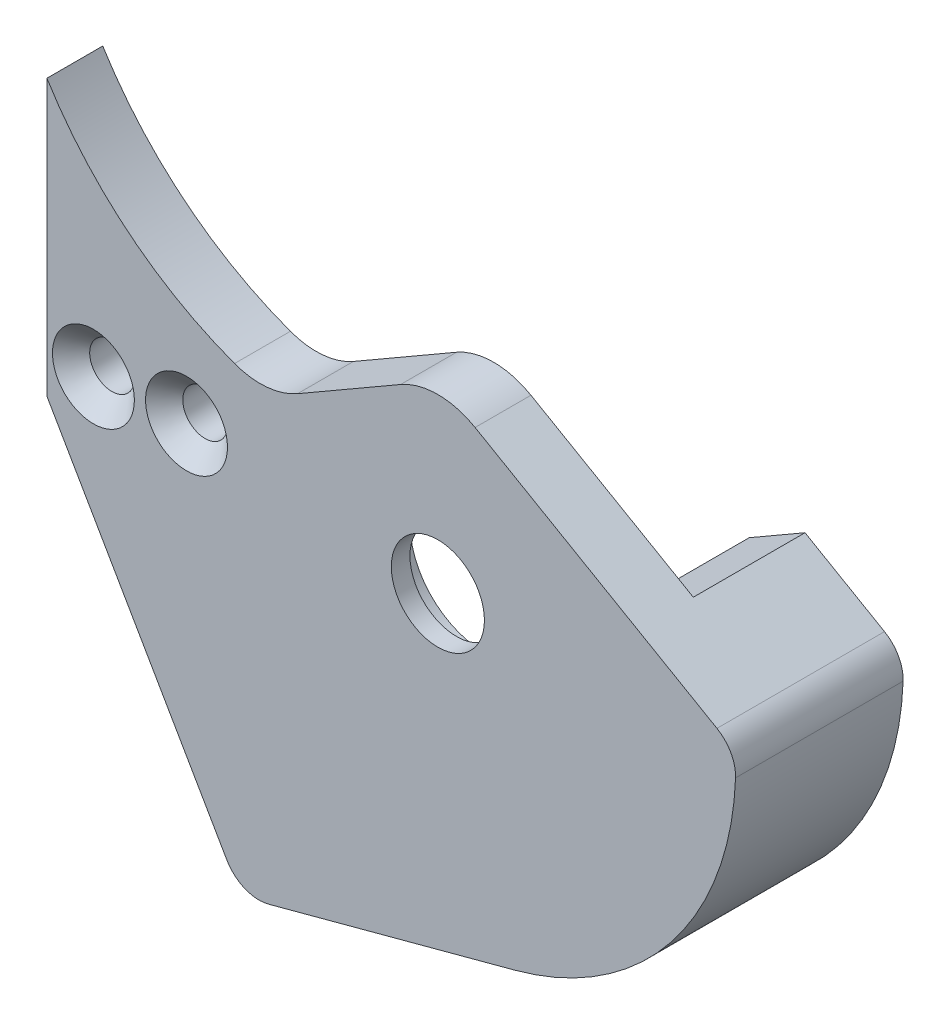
from build123d import *

# Parameters (mm, degrees)
BOSS_EXTRU_1_DEPTH                             = 6
ESQUISSE2_R                                    = 2.5
BOSS_EXTRU_2_DEPTH                             = 3
ESQUISSE3_R                                    = 3
ENL_V_MAT_EXTRU_1_DEPTH                        = 3
CONG_1_R                                       = 4
ESQUISSE4_R                                    = 4
ENL_V_MAT_EXTRU_2_DEPTH                        = 2
FRAISAGE_POUR_VIS_T_TE_FRAIS_E_M21_D           = 2.4
FRAISAGE_POUR_VIS_T_TE_FRAIS_E_M21_CSINK_D     = 4.4
FRAISAGE_POUR_VIS_T_TE_FRAIS_E_M21_CSINK_ANGLE = 90
ESQUISSE10_R                                   = 6
ENL_V_MAT_EXTRU_3_DEPTH                        = 0.5


with BuildPart() as part:
    # Esquisse1 → Boss.-Extru.1 (new body)
    with BuildSketch(Plane.XY):
        with BuildLine():
            Line((18, 42.176914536), (27.666806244, 25.433514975))
            ThreePointArc((27.666806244, 25.433514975), (28.633490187, 24.58575591), (29.916495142, 24.501663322))
            Line((29.916495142, 24.501663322), (43.141104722, 28.045186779))
            ThreePointArc((43.141104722, 28.045186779), (51.513304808, 33.529182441), (54.989286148, 42.91456983))
            ThreePointArc((54.989286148, 42.91456983), (54.740683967, 43.95588854), (53.990625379, 44.719799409))
            Line((53.990625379, 44.719799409), (49.720478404, 47.185169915))
            Line((49.720478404, 47.185169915), (46.720478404, 45.453119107))
            Line((46.720478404, 45.453119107), (50.791893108, 43.102486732))
            ThreePointArc((50.791893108, 43.102486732), (51.612991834, 42.197236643), (51.754055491, 40.983242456))
            ThreePointArc((51.754055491, 40.983242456), (48.494995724, 34.62052613), (42.364647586, 30.942964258))
            Line((42.364647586, 30.942964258), (31.363580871, 27.995237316))
            ThreePointArc((31.363580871, 27.995237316), (30.080575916, 28.079329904), (29.113891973, 28.927088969))
            Line((29.113891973, 28.927088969), (21.342516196, 42.38750666))
            Line((21.342516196, 42.38750666), (18, 42.176914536))
        make_face()
    extrude(amount=BOSS_EXTRU_1_DEPTH)

    # Esquisse2 → Boss.-Extru.2 (add)
    with BuildSketch(Plane.XY.offset(6)):
        with BuildLine():
            Line((18, 42.176914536), (27.666806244, 25.433514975))
            ThreePointArc((27.666806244, 25.433514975), (28.633490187, 24.58575591), (29.916495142, 24.501663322))
            Line((29.916495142, 24.501663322), (43.141104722, 28.045186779))
            ThreePointArc((43.141104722, 28.045186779), (51.513304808, 33.529182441), (54.989286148, 42.91456983))
            ThreePointArc((54.989286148, 42.91456983), (54.740683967, 43.95588854), (53.990625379, 44.719799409))
            Line((53.990625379, 44.719799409), (39, 53.374641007))
            Line((39, 53.374641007), (29.948140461, 48.148547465))
            ThreePointArc((29.948140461, 48.148547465), (23.125628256, 51.406544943), (18, 56.964346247))
            Line((18, 56.964346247), (18, 42.176914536))
        make_face()
        with Locations((39, 43.5)):
            Circle(ESQUISSE2_R, mode=Mode.SUBTRACT)
    extrude(amount=BOSS_EXTRU_2_DEPTH)

    # Esquisse3 → Enl_v. mat.-Extru.1 (cut)
    with BuildSketch(Plane(origin=(31.763139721, 18.338457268, 0), x_dir=(0, 0, 1), z_dir=(-0.8660254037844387, -0.49999999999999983, 0))):
        with Locations((2, 18.526279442)):
            Circle(ESQUISSE3_R)
    extrude(amount=-ENL_V_MAT_EXTRU_1_DEPTH, mode=Mode.SUBTRACT)

    # Cong_1
    cong_1_edges = [part.edges().sort_by_distance(p)[0] for p in [
        (39, 53.374641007, 7.5),
        (29.948140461, 48.148547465, 7.5),
    ]]
    fillet(cong_1_edges, radius=CONG_1_R)

    # Esquisse4 → Enl_v. mat.-Extru.2 (cut)
    with BuildSketch(Plane(origin=(0, 0, 6), x_dir=(-1, 0, 0), z_dir=(0, 0, -1))):
        with Locations((-39, 43.5)):
            Circle(ESQUISSE4_R)
    extrude(amount=-ENL_V_MAT_EXTRU_2_DEPTH, mode=Mode.SUBTRACT)

    # Fraisage pour vis _ t_te frais_e M21 (through all)
    with Locations(Plane.XY.offset(9)):
        with Locations((20.5, 44.338390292), (25.5, 44.65341064)):
            CounterSinkHole(FRAISAGE_POUR_VIS_T_TE_FRAIS_E_M21_D / 2, FRAISAGE_POUR_VIS_T_TE_FRAIS_E_M21_CSINK_D / 2, counter_sink_angle=FRAISAGE_POUR_VIS_T_TE_FRAIS_E_M21_CSINK_ANGLE)

    # Esquisse10 → Enl_v. mat.-Extru.3 (cut)
    with BuildSketch(Plane(origin=(0, 0, 6), x_dir=(-1, 0, 0), z_dir=(0, 0, -1))):
        with Locations((-39, 43.5)):
            Circle(ESQUISSE10_R)
    extrude(amount=-ENL_V_MAT_EXTRU_3_DEPTH, mode=Mode.SUBTRACT)


solid = part.part
